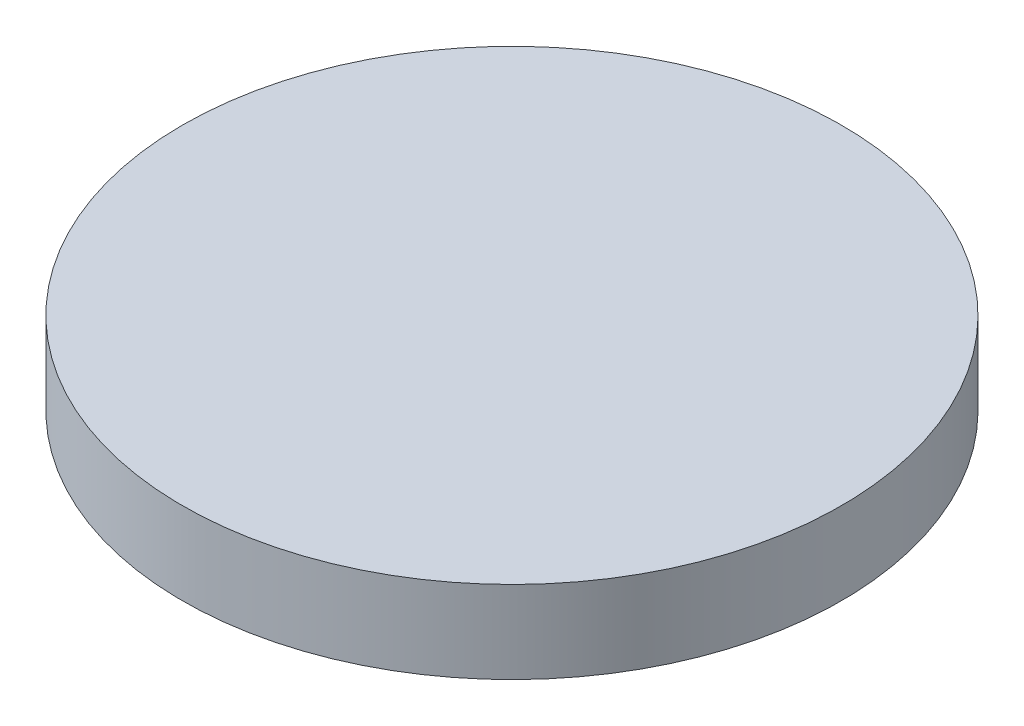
ISO-10303-21;
HEADER;
FILE_DESCRIPTION(('STEP AP214'),'2;1');
FILE_NAME('part.step','',(''),(''),'','','');
FILE_SCHEMA(('AUTOMOTIVE_DESIGN { 1 0 10303 214 1 1 1 1 }'));
ENDSEC;
DATA;
#1=APPLICATION_CONTEXT('core data for automotive mechanical design processes');
#2=APPLICATION_PROTOCOL_DEFINITION('international standard','automotive_design',2000,#1);
#3=PRODUCT_CONTEXT('',#1,'mechanical');
#4=PRODUCT('Part','Part','',(#3));
#5=PRODUCT_RELATED_PRODUCT_CATEGORY('part','',(#4));
#6=PRODUCT_DEFINITION_FORMATION('','',#4);
#7=PRODUCT_DEFINITION_CONTEXT('part definition',#1,'design');
#8=PRODUCT_DEFINITION('design','',#6,#7);
#9=PRODUCT_DEFINITION_SHAPE('','',#8);
#10=(LENGTH_UNIT() NAMED_UNIT(*) SI_UNIT(.MILLI.,.METRE.));
#11=(NAMED_UNIT(*) PLANE_ANGLE_UNIT() SI_UNIT($,.RADIAN.));
#12=(NAMED_UNIT(*) SI_UNIT($,.STERADIAN.) SOLID_ANGLE_UNIT());
#13=UNCERTAINTY_MEASURE_WITH_UNIT(LENGTH_MEASURE(1.E-05),#10,'distance_accuracy_value','');
#14=(GEOMETRIC_REPRESENTATION_CONTEXT(3) GLOBAL_UNCERTAINTY_ASSIGNED_CONTEXT((#13)) GLOBAL_UNIT_ASSIGNED_CONTEXT((#10,
#11,#12)) REPRESENTATION_CONTEXT('',''));
#15=CARTESIAN_POINT('',(0.,0.,0.));
#16=DIRECTION('',(0.,0.,1.));
#17=DIRECTION('',(1.,0.,0.));
#18=AXIS2_PLACEMENT_3D('',#15,#16,#17);
#19=CARTESIAN_POINT('',(0.,60.325,0.));
#20=DIRECTION('',(0.,1.,0.));
#21=DIRECTION('',(-1.,0.,0.));
#22=AXIS2_PLACEMENT_3D('',#19,#20,#21);
#23=SPHERICAL_SURFACE('',#22,53.975);
#24=CARTESIAN_POINT('',(0.,12.7,0.));
#25=DIRECTION('',(0.,1.,0.));
#26=DIRECTION('',(-1.,0.,0.));
#27=AXIS2_PLACEMENT_3D('',#24,#25,#26);
#28=CIRCLE('',#27,25.4);
#29=CARTESIAN_POINT('',(-25.4,12.7,0.));
#30=VERTEX_POINT('',#29);
#31=EDGE_CURVE('E10',#30,#30,#28,.T.);
#32=ORIENTED_EDGE('',*,*,#31,.F.);
#33=EDGE_LOOP('',(#32));
#34=FACE_BOUND('',#33,.T.);
#35=ADVANCED_FACE('F28',(#34),#23,.T.);
#36=CARTESIAN_POINT('',(0.,0.,0.));
#37=DIRECTION('',(0.,1.,0.));
#38=DIRECTION('',(-1.,0.,0.));
#39=AXIS2_PLACEMENT_3D('',#36,#37,#38);
#40=CYLINDRICAL_SURFACE('',#39,25.4);
#41=CARTESIAN_POINT('',(0.,19.05,0.));
#42=DIRECTION('',(0.,1.,0.));
#43=DIRECTION('',(-1.,0.,0.));
#44=AXIS2_PLACEMENT_3D('',#41,#42,#43);
#45=CIRCLE('',#44,25.4);
#46=CARTESIAN_POINT('',(-25.4,19.05,0.));
#47=VERTEX_POINT('',#46);
#48=EDGE_CURVE('E34',#47,#47,#45,.T.);
#49=ORIENTED_EDGE('',*,*,#48,.F.);
#50=EDGE_LOOP('',(#49));
#51=FACE_BOUND('',#50,.T.);
#52=ORIENTED_EDGE('',*,*,#31,.T.);
#53=EDGE_LOOP('',(#52));
#54=FACE_BOUND('',#53,.T.);
#55=ADVANCED_FACE('F42',(#51,#54),#40,.T.);
#56=CARTESIAN_POINT('',(25.4,19.05,0.));
#57=DIRECTION('',(0.,-1.,0.));
#58=DIRECTION('',(1.,0.,0.));
#59=AXIS2_PLACEMENT_3D('',#56,#57,#58);
#60=PLANE('',#59);
#61=ORIENTED_EDGE('',*,*,#48,.T.);
#62=EDGE_LOOP('',(#61));
#63=FACE_BOUND('',#62,.T.);
#64=ADVANCED_FACE('F40',(#63),#60,.F.);
#65=CLOSED_SHELL('',(#35,#55,#64));
#66=MANIFOLD_SOLID_BREP('B2',#65);
#67=ADVANCED_BREP_SHAPE_REPRESENTATION('',(#18,#66),#14);
#68=SHAPE_DEFINITION_REPRESENTATION(#9,#67);
ENDSEC;
END-ISO-10303-21;
